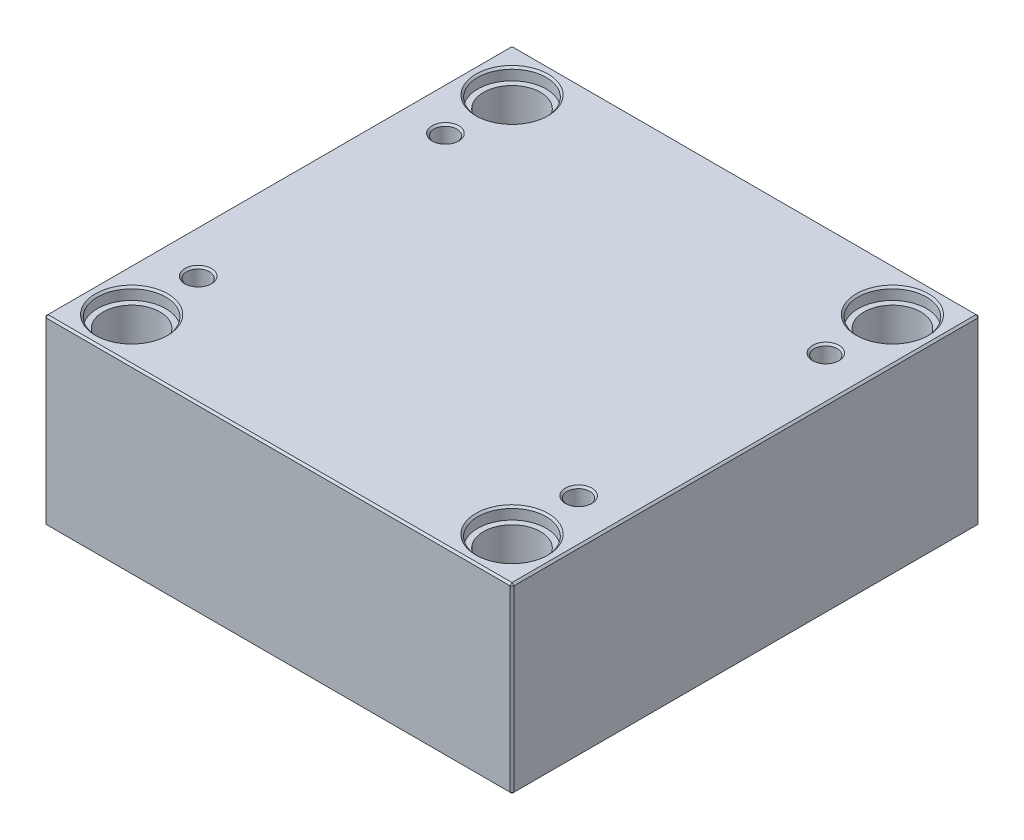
ISO-10303-21;
HEADER;
FILE_DESCRIPTION(('STEP AP214'),'2;1');
FILE_NAME('part.step','',(''),(''),'','','');
FILE_SCHEMA(('AUTOMOTIVE_DESIGN { 1 0 10303 214 1 1 1 1 }'));
ENDSEC;
DATA;
#1=APPLICATION_CONTEXT('core data for automotive mechanical design processes');
#2=APPLICATION_PROTOCOL_DEFINITION('international standard','automotive_design',2000,#1);
#3=PRODUCT_CONTEXT('',#1,'mechanical');
#4=PRODUCT('Part','Part','',(#3));
#5=PRODUCT_RELATED_PRODUCT_CATEGORY('part','',(#4));
#6=PRODUCT_DEFINITION_FORMATION('','',#4);
#7=PRODUCT_DEFINITION_CONTEXT('part definition',#1,'design');
#8=PRODUCT_DEFINITION('design','',#6,#7);
#9=PRODUCT_DEFINITION_SHAPE('','',#8);
#10=(LENGTH_UNIT() NAMED_UNIT(*) SI_UNIT(.MILLI.,.METRE.));
#11=(NAMED_UNIT(*) PLANE_ANGLE_UNIT() SI_UNIT($,.RADIAN.));
#12=(NAMED_UNIT(*) SI_UNIT($,.STERADIAN.) SOLID_ANGLE_UNIT());
#13=UNCERTAINTY_MEASURE_WITH_UNIT(LENGTH_MEASURE(1.E-05),#10,'distance_accuracy_value','');
#14=(GEOMETRIC_REPRESENTATION_CONTEXT(3) GLOBAL_UNCERTAINTY_ASSIGNED_CONTEXT((#13)) GLOBAL_UNIT_ASSIGNED_CONTEXT((#10,
#11,#12)) REPRESENTATION_CONTEXT('',''));
#15=CARTESIAN_POINT('',(0.,0.,0.));
#16=DIRECTION('',(0.,0.,1.));
#17=DIRECTION('',(1.,0.,0.));
#18=AXIS2_PLACEMENT_3D('',#15,#16,#17);
#19=CARTESIAN_POINT('',(-100.,0.,-100.));
#20=DIRECTION('',(0.,1.,0.));
#21=DIRECTION('',(0.,0.,1.));
#22=AXIS2_PLACEMENT_3D('',#19,#20,#21);
#23=CYLINDRICAL_SURFACE('',#22,15.);
#24=CARTESIAN_POINT('',(-100.,1.00000000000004,-100.));
#25=DIRECTION('',(0.,1.,0.));
#26=DIRECTION('',(0.,0.,1.));
#27=AXIS2_PLACEMENT_3D('',#24,#25,#26);
#28=CIRCLE('',#27,15.);
#29=CARTESIAN_POINT('',(-100.,1.00000000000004,-85.));
#30=VERTEX_POINT('',#29);
#31=EDGE_CURVE('E472',#30,#30,#28,.F.);
#32=ORIENTED_EDGE('',*,*,#31,.T.);
#33=EDGE_LOOP('',(#32));
#34=FACE_BOUND('',#33,.T.);
#35=CARTESIAN_POINT('',(-100.,89.7,-100.));
#36=DIRECTION('',(0.,1.,0.));
#37=DIRECTION('',(0.,0.,1.));
#38=AXIS2_PLACEMENT_3D('',#35,#36,#37);
#39=CIRCLE('',#38,15.);
#40=CARTESIAN_POINT('',(-100.,89.7,-85.));
#41=VERTEX_POINT('',#40);
#42=EDGE_CURVE('E221',#41,#41,#39,.F.);
#43=ORIENTED_EDGE('',*,*,#42,.F.);
#44=EDGE_LOOP('',(#43));
#45=FACE_BOUND('',#44,.T.);
#46=ADVANCED_FACE('F16',(#34,#45),#23,.F.);
#47=CARTESIAN_POINT('',(100.,0.,-100.));
#48=DIRECTION('',(0.,1.,0.));
#49=DIRECTION('',(0.,0.,1.));
#50=AXIS2_PLACEMENT_3D('',#47,#48,#49);
#51=CYLINDRICAL_SURFACE('',#50,15.);
#52=CARTESIAN_POINT('',(100.,1.00000000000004,-100.));
#53=DIRECTION('',(0.,1.,0.));
#54=DIRECTION('',(0.,0.,1.));
#55=AXIS2_PLACEMENT_3D('',#52,#53,#54);
#56=CIRCLE('',#55,15.);
#57=CARTESIAN_POINT('',(100.,1.00000000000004,-85.));
#58=VERTEX_POINT('',#57);
#59=EDGE_CURVE('E474',#58,#58,#56,.F.);
#60=ORIENTED_EDGE('',*,*,#59,.T.);
#61=EDGE_LOOP('',(#60));
#62=FACE_BOUND('',#61,.T.);
#63=CARTESIAN_POINT('',(100.,89.7,-100.));
#64=DIRECTION('',(0.,1.,0.));
#65=DIRECTION('',(0.,0.,1.));
#66=AXIS2_PLACEMENT_3D('',#63,#64,#65);
#67=CIRCLE('',#66,15.);
#68=CARTESIAN_POINT('',(100.,89.7,-85.));
#69=VERTEX_POINT('',#68);
#70=EDGE_CURVE('E218',#69,#69,#67,.F.);
#71=ORIENTED_EDGE('',*,*,#70,.F.);
#72=EDGE_LOOP('',(#71));
#73=FACE_BOUND('',#72,.T.);
#74=ADVANCED_FACE('F263',(#62,#73),#51,.F.);
#75=CARTESIAN_POINT('',(100.,0.,100.));
#76=DIRECTION('',(0.,1.,0.));
#77=DIRECTION('',(0.,0.,1.));
#78=AXIS2_PLACEMENT_3D('',#75,#76,#77);
#79=CYLINDRICAL_SURFACE('',#78,15.);
#80=CARTESIAN_POINT('',(100.,1.00000000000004,100.));
#81=DIRECTION('',(0.,1.,0.));
#82=DIRECTION('',(0.,0.,1.));
#83=AXIS2_PLACEMENT_3D('',#80,#81,#82);
#84=CIRCLE('',#83,15.);
#85=CARTESIAN_POINT('',(100.,1.00000000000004,115.));
#86=VERTEX_POINT('',#85);
#87=EDGE_CURVE('E477',#86,#86,#84,.F.);
#88=ORIENTED_EDGE('',*,*,#87,.T.);
#89=EDGE_LOOP('',(#88));
#90=FACE_BOUND('',#89,.T.);
#91=CARTESIAN_POINT('',(100.,89.7,100.));
#92=DIRECTION('',(0.,1.,0.));
#93=DIRECTION('',(0.,0.,1.));
#94=AXIS2_PLACEMENT_3D('',#91,#92,#93);
#95=CIRCLE('',#94,15.);
#96=CARTESIAN_POINT('',(100.,89.7,115.));
#97=VERTEX_POINT('',#96);
#98=EDGE_CURVE('E214',#97,#97,#95,.F.);
#99=ORIENTED_EDGE('',*,*,#98,.F.);
#100=EDGE_LOOP('',(#99));
#101=FACE_BOUND('',#100,.T.);
#102=ADVANCED_FACE('F270',(#90,#101),#79,.F.);
#103=CARTESIAN_POINT('',(-100.,0.,100.));
#104=DIRECTION('',(0.,1.,0.));
#105=DIRECTION('',(0.,0.,1.));
#106=AXIS2_PLACEMENT_3D('',#103,#104,#105);
#107=CYLINDRICAL_SURFACE('',#106,15.);
#108=CARTESIAN_POINT('',(-100.,1.00000000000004,100.));
#109=DIRECTION('',(0.,1.,0.));
#110=DIRECTION('',(0.,0.,1.));
#111=AXIS2_PLACEMENT_3D('',#108,#109,#110);
#112=CIRCLE('',#111,15.);
#113=CARTESIAN_POINT('',(-100.,1.00000000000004,115.));
#114=VERTEX_POINT('',#113);
#115=EDGE_CURVE('E480',#114,#114,#112,.F.);
#116=ORIENTED_EDGE('',*,*,#115,.T.);
#117=EDGE_LOOP('',(#116));
#118=FACE_BOUND('',#117,.T.);
#119=CARTESIAN_POINT('',(-100.,89.7,100.));
#120=DIRECTION('',(0.,1.,0.));
#121=DIRECTION('',(0.,0.,1.));
#122=AXIS2_PLACEMENT_3D('',#119,#120,#121);
#123=CIRCLE('',#122,15.);
#124=CARTESIAN_POINT('',(-100.,89.7,115.));
#125=VERTEX_POINT('',#124);
#126=EDGE_CURVE('E211',#125,#125,#123,.F.);
#127=ORIENTED_EDGE('',*,*,#126,.F.);
#128=EDGE_LOOP('',(#127));
#129=FACE_BOUND('',#128,.T.);
#130=ADVANCED_FACE('F277',(#118,#129),#107,.F.);
#131=CARTESIAN_POINT('',(-123.,96.,123.));
#132=DIRECTION('',(1.,0.,0.));
#133=DIRECTION('',(0.,0.,-1.));
#134=AXIS2_PLACEMENT_3D('',#131,#132,#133);
#135=PLANE('',#134);
#136=DIRECTION('',(0.,-1.,0.));
#137=VECTOR('',#136,1.);
#138=CARTESIAN_POINT('',(-123.,96.,-122.));
#139=LINE('',#138,#137);
#140=CARTESIAN_POINT('',(-123.,95.,-122.));
#141=VERTEX_POINT('',#140);
#142=CARTESIAN_POINT('',(-123.,1.00000000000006,-122.));
#143=VERTEX_POINT('',#142);
#144=EDGE_CURVE('E487',#141,#143,#139,.T.);
#145=ORIENTED_EDGE('',*,*,#144,.T.);
#146=DIRECTION('',(0.,0.,1.));
#147=VECTOR('',#146,1.);
#148=CARTESIAN_POINT('',(-123.,1.00000000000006,123.));
#149=LINE('',#148,#147);
#150=CARTESIAN_POINT('',(-123.,1.00000000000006,122.));
#151=VERTEX_POINT('',#150);
#152=EDGE_CURVE('E490',#143,#151,#149,.T.);
#153=ORIENTED_EDGE('',*,*,#152,.T.);
#154=DIRECTION('',(0.,1.,0.));
#155=VECTOR('',#154,1.);
#156=CARTESIAN_POINT('',(-123.,96.,122.));
#157=LINE('',#156,#155);
#158=CARTESIAN_POINT('',(-123.,95.,122.));
#159=VERTEX_POINT('',#158);
#160=EDGE_CURVE('E485',#151,#159,#157,.T.);
#161=ORIENTED_EDGE('',*,*,#160,.T.);
#162=DIRECTION('',(0.,0.,-1.));
#163=VECTOR('',#162,1.);
#164=CARTESIAN_POINT('',(-123.,95.,-123.));
#165=LINE('',#164,#163);
#166=EDGE_CURVE('E483',#159,#141,#165,.T.);
#167=ORIENTED_EDGE('',*,*,#166,.T.);
#168=EDGE_LOOP('',(#145,#153,#161,#167));
#169=FACE_BOUND('',#168,.T.);
#170=ADVANCED_FACE('F298',(#169),#135,.F.);
#171=CARTESIAN_POINT('',(123.,96.,123.));
#172=DIRECTION('',(0.,0.,-1.));
#173=DIRECTION('',(-1.,0.,0.));
#174=AXIS2_PLACEMENT_3D('',#171,#172,#173);
#175=PLANE('',#174);
#176=DIRECTION('',(-1.,0.,0.));
#177=VECTOR('',#176,1.);
#178=CARTESIAN_POINT('',(-123.,95.,123.));
#179=LINE('',#178,#177);
#180=CARTESIAN_POINT('',(122.,95.,123.));
#181=VERTEX_POINT('',#180);
#182=CARTESIAN_POINT('',(-122.,95.,123.));
#183=VERTEX_POINT('',#182);
#184=EDGE_CURVE('E509',#181,#183,#179,.T.);
#185=ORIENTED_EDGE('',*,*,#184,.T.);
#186=DIRECTION('',(0.,-1.,0.));
#187=VECTOR('',#186,1.);
#188=CARTESIAN_POINT('',(-122.,96.,123.));
#189=LINE('',#188,#187);
#190=CARTESIAN_POINT('',(-122.,1.00000000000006,123.));
#191=VERTEX_POINT('',#190);
#192=EDGE_CURVE('E515',#183,#191,#189,.T.);
#193=ORIENTED_EDGE('',*,*,#192,.T.);
#194=DIRECTION('',(1.,0.,0.));
#195=VECTOR('',#194,1.);
#196=CARTESIAN_POINT('',(123.,1.00000000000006,123.));
#197=LINE('',#196,#195);
#198=CARTESIAN_POINT('',(122.,1.00000000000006,123.));
#199=VERTEX_POINT('',#198);
#200=EDGE_CURVE('E513',#191,#199,#197,.T.);
#201=ORIENTED_EDGE('',*,*,#200,.T.);
#202=DIRECTION('',(0.,1.,0.));
#203=VECTOR('',#202,1.);
#204=CARTESIAN_POINT('',(122.,96.,123.));
#205=LINE('',#204,#203);
#206=EDGE_CURVE('E511',#199,#181,#205,.T.);
#207=ORIENTED_EDGE('',*,*,#206,.T.);
#208=EDGE_LOOP('',(#185,#193,#201,#207));
#209=FACE_BOUND('',#208,.T.);
#210=ADVANCED_FACE('F294',(#209),#175,.F.);
#211=CARTESIAN_POINT('',(123.,96.,123.));
#212=DIRECTION('',(-1.,0.,0.));
#213=DIRECTION('',(0.,0.,1.));
#214=AXIS2_PLACEMENT_3D('',#211,#212,#213);
#215=PLANE('',#214);
#216=DIRECTION('',(0.,0.,-1.));
#217=VECTOR('',#216,1.);
#218=CARTESIAN_POINT('',(123.,1.00000000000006,123.));
#219=LINE('',#218,#217);
#220=CARTESIAN_POINT('',(123.,1.00000000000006,122.));
#221=VERTEX_POINT('',#220);
#222=CARTESIAN_POINT('',(123.,1.00000000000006,-122.));
#223=VERTEX_POINT('',#222);
#224=EDGE_CURVE('E504',#221,#223,#219,.T.);
#225=ORIENTED_EDGE('',*,*,#224,.T.);
#226=DIRECTION('',(0.,1.,0.));
#227=VECTOR('',#226,1.);
#228=CARTESIAN_POINT('',(123.,96.,-122.));
#229=LINE('',#228,#227);
#230=CARTESIAN_POINT('',(123.,95.,-122.));
#231=VERTEX_POINT('',#230);
#232=EDGE_CURVE('E506',#223,#231,#229,.T.);
#233=ORIENTED_EDGE('',*,*,#232,.T.);
#234=DIRECTION('',(0.,0.,1.));
#235=VECTOR('',#234,1.);
#236=CARTESIAN_POINT('',(123.,95.,123.));
#237=LINE('',#236,#235);
#238=CARTESIAN_POINT('',(123.,95.,122.));
#239=VERTEX_POINT('',#238);
#240=EDGE_CURVE('E500',#231,#239,#237,.T.);
#241=ORIENTED_EDGE('',*,*,#240,.T.);
#242=DIRECTION('',(0.,-1.,0.));
#243=VECTOR('',#242,1.);
#244=CARTESIAN_POINT('',(123.,96.,122.));
#245=LINE('',#244,#243);
#246=EDGE_CURVE('E502',#239,#221,#245,.T.);
#247=ORIENTED_EDGE('',*,*,#246,.T.);
#248=EDGE_LOOP('',(#225,#233,#241,#247));
#249=FACE_BOUND('',#248,.T.);
#250=ADVANCED_FACE('F290',(#249),#215,.F.);
#251=CARTESIAN_POINT('',(123.,96.,-123.));
#252=DIRECTION('',(0.,0.,1.));
#253=DIRECTION('',(1.,0.,0.));
#254=AXIS2_PLACEMENT_3D('',#251,#252,#253);
#255=PLANE('',#254);
#256=DIRECTION('',(0.,-1.,0.));
#257=VECTOR('',#256,1.);
#258=CARTESIAN_POINT('',(122.,96.,-123.));
#259=LINE('',#258,#257);
#260=CARTESIAN_POINT('',(122.,95.,-123.));
#261=VERTEX_POINT('',#260);
#262=CARTESIAN_POINT('',(122.,1.00000000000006,-123.));
#263=VERTEX_POINT('',#262);
#264=EDGE_CURVE('E494',#261,#263,#259,.T.);
#265=ORIENTED_EDGE('',*,*,#264,.T.);
#266=DIRECTION('',(-1.,0.,0.));
#267=VECTOR('',#266,1.);
#268=CARTESIAN_POINT('',(123.,1.00000000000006,-123.));
#269=LINE('',#268,#267);
#270=CARTESIAN_POINT('',(-122.,1.00000000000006,-123.));
#271=VERTEX_POINT('',#270);
#272=EDGE_CURVE('E138',#263,#271,#269,.T.);
#273=ORIENTED_EDGE('',*,*,#272,.T.);
#274=DIRECTION('',(0.,1.,0.));
#275=VECTOR('',#274,1.);
#276=CARTESIAN_POINT('',(-122.,96.,-123.));
#277=LINE('',#276,#275);
#278=CARTESIAN_POINT('',(-122.,95.,-123.));
#279=VERTEX_POINT('',#278);
#280=EDGE_CURVE('E496',#271,#279,#277,.T.);
#281=ORIENTED_EDGE('',*,*,#280,.T.);
#282=DIRECTION('',(1.,0.,0.));
#283=VECTOR('',#282,1.);
#284=CARTESIAN_POINT('',(123.,95.,-123.));
#285=LINE('',#284,#283);
#286=EDGE_CURVE('E492',#279,#261,#285,.T.);
#287=ORIENTED_EDGE('',*,*,#286,.T.);
#288=EDGE_LOOP('',(#265,#273,#281,#287));
#289=FACE_BOUND('',#288,.T.);
#290=ADVANCED_FACE('F282',(#289),#255,.F.);
#291=CARTESIAN_POINT('',(0.,96.,0.));
#292=DIRECTION('',(0.,1.,0.));
#293=DIRECTION('',(0.,0.,1.));
#294=AXIS2_PLACEMENT_3D('',#291,#292,#293);
#295=PLANE('',#294);
#296=CARTESIAN_POINT('',(100.,96.,100.));
#297=DIRECTION('',(0.,1.,0.));
#298=DIRECTION('',(0.,0.,1.));
#299=AXIS2_PLACEMENT_3D('',#296,#297,#298);
#300=CIRCLE('',#299,19.);
#301=CARTESIAN_POINT('',(100.,96.,119.));
#302=VERTEX_POINT('',#301);
#303=EDGE_CURVE('E236',#302,#302,#300,.F.);
#304=ORIENTED_EDGE('',*,*,#303,.T.);
#305=EDGE_LOOP('',(#304));
#306=FACE_BOUND('',#305,.T.);
#307=CARTESIAN_POINT('',(-100.,96.,100.));
#308=DIRECTION('',(0.,1.,0.));
#309=DIRECTION('',(0.,0.,1.));
#310=AXIS2_PLACEMENT_3D('',#307,#308,#309);
#311=CIRCLE('',#310,19.);
#312=CARTESIAN_POINT('',(-100.,96.,119.));
#313=VERTEX_POINT('',#312);
#314=EDGE_CURVE('E233',#313,#313,#311,.F.);
#315=ORIENTED_EDGE('',*,*,#314,.T.);
#316=EDGE_LOOP('',(#315));
#317=FACE_BOUND('',#316,.T.);
#318=CARTESIAN_POINT('',(100.,96.,-100.));
#319=DIRECTION('',(0.,1.,0.));
#320=DIRECTION('',(0.,0.,1.));
#321=AXIS2_PLACEMENT_3D('',#318,#319,#320);
#322=CIRCLE('',#321,19.);
#323=CARTESIAN_POINT('',(100.,96.,-81.));
#324=VERTEX_POINT('',#323);
#325=EDGE_CURVE('E230',#324,#324,#322,.F.);
#326=ORIENTED_EDGE('',*,*,#325,.T.);
#327=EDGE_LOOP('',(#326));
#328=FACE_BOUND('',#327,.T.);
#329=CARTESIAN_POINT('',(-100.,96.,-100.));
#330=DIRECTION('',(0.,1.,0.));
#331=DIRECTION('',(0.,0.,1.));
#332=AXIS2_PLACEMENT_3D('',#329,#330,#331);
#333=CIRCLE('',#332,19.);
#334=CARTESIAN_POINT('',(-100.,96.,-81.));
#335=VERTEX_POINT('',#334);
#336=EDGE_CURVE('E227',#335,#335,#333,.F.);
#337=ORIENTED_EDGE('',*,*,#336,.T.);
#338=EDGE_LOOP('',(#337));
#339=FACE_BOUND('',#338,.T.);
#340=CARTESIAN_POINT('',(-100.,96.,65.));
#341=DIRECTION('',(0.,1.,0.));
#342=DIRECTION('',(0.,0.,1.));
#343=AXIS2_PLACEMENT_3D('',#340,#341,#342);
#344=CIRCLE('',#343,7.);
#345=CARTESIAN_POINT('',(-100.,96.,72.));
#346=VERTEX_POINT('',#345);
#347=EDGE_CURVE('E198',#346,#346,#344,.F.);
#348=ORIENTED_EDGE('',*,*,#347,.T.);
#349=EDGE_LOOP('',(#348));
#350=FACE_BOUND('',#349,.T.);
#351=CARTESIAN_POINT('',(100.,96.,65.));
#352=DIRECTION('',(0.,1.,0.));
#353=DIRECTION('',(0.,0.,1.));
#354=AXIS2_PLACEMENT_3D('',#351,#352,#353);
#355=CIRCLE('',#354,7.);
#356=CARTESIAN_POINT('',(100.,96.,72.));
#357=VERTEX_POINT('',#356);
#358=EDGE_CURVE('E195',#357,#357,#355,.F.);
#359=ORIENTED_EDGE('',*,*,#358,.T.);
#360=EDGE_LOOP('',(#359));
#361=FACE_BOUND('',#360,.T.);
#362=CARTESIAN_POINT('',(100.,96.,-65.));
#363=DIRECTION('',(0.,1.,0.));
#364=DIRECTION('',(0.,0.,1.));
#365=AXIS2_PLACEMENT_3D('',#362,#363,#364);
#366=CIRCLE('',#365,7.);
#367=CARTESIAN_POINT('',(100.,96.,-58.));
#368=VERTEX_POINT('',#367);
#369=EDGE_CURVE('E192',#368,#368,#366,.F.);
#370=ORIENTED_EDGE('',*,*,#369,.T.);
#371=EDGE_LOOP('',(#370));
#372=FACE_BOUND('',#371,.T.);
#373=CARTESIAN_POINT('',(-100.,96.,-65.));
#374=DIRECTION('',(0.,1.,0.));
#375=DIRECTION('',(0.,0.,1.));
#376=AXIS2_PLACEMENT_3D('',#373,#374,#375);
#377=CIRCLE('',#376,7.);
#378=CARTESIAN_POINT('',(-100.,96.,-58.));
#379=VERTEX_POINT('',#378);
#380=EDGE_CURVE('E188',#379,#379,#377,.F.);
#381=ORIENTED_EDGE('',*,*,#380,.T.);
#382=EDGE_LOOP('',(#381));
#383=FACE_BOUND('',#382,.T.);
#384=DIRECTION('',(0.,0.,-1.));
#385=VECTOR('',#384,1.);
#386=CARTESIAN_POINT('',(122.,96.,-123.));
#387=LINE('',#386,#385);
#388=CARTESIAN_POINT('',(122.,96.,122.));
#389=VERTEX_POINT('',#388);
#390=CARTESIAN_POINT('',(122.,96.,-122.));
#391=VERTEX_POINT('',#390);
#392=EDGE_CURVE('E31',#389,#391,#387,.T.);
#393=ORIENTED_EDGE('',*,*,#392,.T.);
#394=DIRECTION('',(-1.,0.,0.));
#395=VECTOR('',#394,1.);
#396=CARTESIAN_POINT('',(-123.,96.,-122.));
#397=LINE('',#396,#395);
#398=CARTESIAN_POINT('',(-122.,96.,-122.));
#399=VERTEX_POINT('',#398);
#400=EDGE_CURVE('E189',#391,#399,#397,.T.);
#401=ORIENTED_EDGE('',*,*,#400,.T.);
#402=DIRECTION('',(0.,0.,1.));
#403=VECTOR('',#402,1.);
#404=CARTESIAN_POINT('',(-122.,96.,123.));
#405=LINE('',#404,#403);
#406=CARTESIAN_POINT('',(-122.,96.,122.));
#407=VERTEX_POINT('',#406);
#408=EDGE_CURVE('E518',#399,#407,#405,.T.);
#409=ORIENTED_EDGE('',*,*,#408,.T.);
#410=DIRECTION('',(1.,0.,0.));
#411=VECTOR('',#410,1.);
#412=CARTESIAN_POINT('',(123.,96.,122.));
#413=LINE('',#412,#411);
#414=EDGE_CURVE('E36',#407,#389,#413,.T.);
#415=ORIENTED_EDGE('',*,*,#414,.T.);
#416=EDGE_LOOP('',(#393,#401,#409,#415));
#417=FACE_BOUND('',#416,.T.);
#418=ADVANCED_FACE('F279',(#306,#317,#328,#339,#350,#361,#372,#383,#417),#295,.T.);
#419=CARTESIAN_POINT('',(0.,0.,0.));
#420=DIRECTION('',(0.,1.,0.));
#421=DIRECTION('',(0.,0.,1.));
#422=AXIS2_PLACEMENT_3D('',#419,#420,#421);
#423=PLANE('',#422);
#424=CARTESIAN_POINT('',(-100.,0.,-100.));
#425=DIRECTION('',(0.,1.,0.));
#426=DIRECTION('',(0.,0.,1.));
#427=AXIS2_PLACEMENT_3D('',#424,#425,#426);
#428=CIRCLE('',#427,16.);
#429=CARTESIAN_POINT('',(-100.,0.,-84.));
#430=VERTEX_POINT('',#429);
#431=EDGE_CURVE('E469',#430,#430,#428,.T.);
#432=ORIENTED_EDGE('',*,*,#431,.T.);
#433=EDGE_LOOP('',(#432));
#434=FACE_BOUND('',#433,.T.);
#435=CARTESIAN_POINT('',(100.,0.,-100.));
#436=DIRECTION('',(0.,1.,0.));
#437=DIRECTION('',(0.,0.,1.));
#438=AXIS2_PLACEMENT_3D('',#435,#436,#437);
#439=CIRCLE('',#438,16.);
#440=CARTESIAN_POINT('',(100.,0.,-84.));
#441=VERTEX_POINT('',#440);
#442=EDGE_CURVE('E466',#441,#441,#439,.T.);
#443=ORIENTED_EDGE('',*,*,#442,.T.);
#444=EDGE_LOOP('',(#443));
#445=FACE_BOUND('',#444,.T.);
#446=CARTESIAN_POINT('',(100.,0.,100.));
#447=DIRECTION('',(0.,1.,0.));
#448=DIRECTION('',(0.,0.,1.));
#449=AXIS2_PLACEMENT_3D('',#446,#447,#448);
#450=CIRCLE('',#449,16.);
#451=CARTESIAN_POINT('',(100.,0.,116.));
#452=VERTEX_POINT('',#451);
#453=EDGE_CURVE('E463',#452,#452,#450,.T.);
#454=ORIENTED_EDGE('',*,*,#453,.T.);
#455=EDGE_LOOP('',(#454));
#456=FACE_BOUND('',#455,.T.);
#457=CARTESIAN_POINT('',(-100.,0.,100.));
#458=DIRECTION('',(0.,1.,0.));
#459=DIRECTION('',(0.,0.,1.));
#460=AXIS2_PLACEMENT_3D('',#457,#458,#459);
#461=CIRCLE('',#460,16.);
#462=CARTESIAN_POINT('',(-100.,0.,116.));
#463=VERTEX_POINT('',#462);
#464=EDGE_CURVE('E460',#463,#463,#461,.T.);
#465=ORIENTED_EDGE('',*,*,#464,.T.);
#466=EDGE_LOOP('',(#465));
#467=FACE_BOUND('',#466,.T.);
#468=DIRECTION('',(0.,0.,1.));
#469=VECTOR('',#468,1.);
#470=CARTESIAN_POINT('',(122.,0.,0.));
#471=LINE('',#470,#469);
#472=CARTESIAN_POINT('',(122.,0.,-122.));
#473=VERTEX_POINT('',#472);
#474=CARTESIAN_POINT('',(122.,0.,122.));
#475=VERTEX_POINT('',#474);
#476=EDGE_CURVE('E108',#473,#475,#471,.T.);
#477=ORIENTED_EDGE('',*,*,#476,.T.);
#478=DIRECTION('',(-1.,0.,0.));
#479=VECTOR('',#478,1.);
#480=CARTESIAN_POINT('',(0.,0.,122.));
#481=LINE('',#480,#479);
#482=CARTESIAN_POINT('',(-122.,0.,122.));
#483=VERTEX_POINT('',#482);
#484=EDGE_CURVE('E458',#475,#483,#481,.T.);
#485=ORIENTED_EDGE('',*,*,#484,.T.);
#486=DIRECTION('',(0.,0.,-1.));
#487=VECTOR('',#486,1.);
#488=CARTESIAN_POINT('',(-122.,0.,0.));
#489=LINE('',#488,#487);
#490=CARTESIAN_POINT('',(-122.,0.,-122.));
#491=VERTEX_POINT('',#490);
#492=EDGE_CURVE('E110',#483,#491,#489,.T.);
#493=ORIENTED_EDGE('',*,*,#492,.T.);
#494=DIRECTION('',(1.,0.,0.));
#495=VECTOR('',#494,1.);
#496=CARTESIAN_POINT('',(0.,0.,-122.));
#497=LINE('',#496,#495);
#498=EDGE_CURVE('E104',#491,#473,#497,.T.);
#499=ORIENTED_EDGE('',*,*,#498,.T.);
#500=EDGE_LOOP('',(#477,#485,#493,#499));
#501=FACE_BOUND('',#500,.T.);
#502=ADVANCED_FACE('F106',(#434,#445,#456,#467,#501),#423,.F.);
#503=CARTESIAN_POINT('',(-100.,0.,-100.));
#504=DIRECTION('',(0.,-1.,0.));
#505=DIRECTION('',(0.,0.,-1.));
#506=AXIS2_PLACEMENT_3D('',#503,#504,#505);
#507=CONICAL_SURFACE('',#506,16.,0.785398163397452);
#508=ORIENTED_EDGE('',*,*,#31,.F.);
#509=EDGE_LOOP('',(#508));
#510=FACE_BOUND('',#509,.T.);
#511=ORIENTED_EDGE('',*,*,#431,.F.);
#512=EDGE_LOOP('',(#511));
#513=FACE_BOUND('',#512,.T.);
#514=ADVANCED_FACE('F286',(#510,#513),#507,.F.);
#515=CARTESIAN_POINT('',(100.,0.,-100.));
#516=DIRECTION('',(0.,-1.,0.));
#517=DIRECTION('',(0.,0.,-1.));
#518=AXIS2_PLACEMENT_3D('',#515,#516,#517);
#519=CONICAL_SURFACE('',#518,16.,0.785398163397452);
#520=ORIENTED_EDGE('',*,*,#59,.F.);
#521=EDGE_LOOP('',(#520));
#522=FACE_BOUND('',#521,.T.);
#523=ORIENTED_EDGE('',*,*,#442,.F.);
#524=EDGE_LOOP('',(#523));
#525=FACE_BOUND('',#524,.T.);
#526=ADVANCED_FACE('F305',(#522,#525),#519,.F.);
#527=CARTESIAN_POINT('',(100.,0.,100.));
#528=DIRECTION('',(0.,-1.,0.));
#529=DIRECTION('',(0.,0.,-1.));
#530=AXIS2_PLACEMENT_3D('',#527,#528,#529);
#531=CONICAL_SURFACE('',#530,16.,0.785398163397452);
#532=ORIENTED_EDGE('',*,*,#87,.F.);
#533=EDGE_LOOP('',(#532));
#534=FACE_BOUND('',#533,.T.);
#535=ORIENTED_EDGE('',*,*,#453,.F.);
#536=EDGE_LOOP('',(#535));
#537=FACE_BOUND('',#536,.T.);
#538=ADVANCED_FACE('F309',(#534,#537),#531,.F.);
#539=CARTESIAN_POINT('',(-100.,0.,100.));
#540=DIRECTION('',(0.,-1.,0.));
#541=DIRECTION('',(0.,0.,-1.));
#542=AXIS2_PLACEMENT_3D('',#539,#540,#541);
#543=CONICAL_SURFACE('',#542,16.,0.785398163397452);
#544=ORIENTED_EDGE('',*,*,#115,.F.);
#545=EDGE_LOOP('',(#544));
#546=FACE_BOUND('',#545,.T.);
#547=ORIENTED_EDGE('',*,*,#464,.F.);
#548=EDGE_LOOP('',(#547));
#549=FACE_BOUND('',#548,.T.);
#550=ADVANCED_FACE('F313',(#546,#549),#543,.F.);
#551=CARTESIAN_POINT('',(123.,96.,122.));
#552=DIRECTION('',(-0.707106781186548,0.,-0.707106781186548));
#553=DIRECTION('',(0.,-1.,0.));
#554=AXIS2_PLACEMENT_3D('',#551,#552,#553);
#555=PLANE('',#554);
#556=DIRECTION('',(-0.707106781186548,0.,0.707106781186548));
#557=VECTOR('',#556,1.);
#558=CARTESIAN_POINT('',(122.,95.,123.));
#559=LINE('',#558,#557);
#560=EDGE_CURVE('E126',#181,#239,#559,.F.);
#561=ORIENTED_EDGE('',*,*,#560,.F.);
#562=ORIENTED_EDGE('',*,*,#206,.F.);
#563=DIRECTION('',(0.707106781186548,0.,-0.707106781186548));
#564=VECTOR('',#563,1.);
#565=CARTESIAN_POINT('',(122.,1.00000000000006,123.));
#566=LINE('',#565,#564);
#567=EDGE_CURVE('E180',#221,#199,#566,.F.);
#568=ORIENTED_EDGE('',*,*,#567,.F.);
#569=ORIENTED_EDGE('',*,*,#246,.F.);
#570=EDGE_LOOP('',(#561,#562,#568,#569));
#571=FACE_BOUND('',#570,.T.);
#572=ADVANCED_FACE('F317',(#571),#555,.F.);
#573=CARTESIAN_POINT('',(122.,95.,123.));
#574=DIRECTION('',(0.577350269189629,0.57735026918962,0.577350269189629));
#575=DIRECTION('',(0.707106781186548,0.,-0.707106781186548));
#576=AXIS2_PLACEMENT_3D('',#573,#574,#575);
#577=PLANE('',#576);
#578=DIRECTION('',(0.,-0.70710678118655,0.707106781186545));
#579=VECTOR('',#578,1.);
#580=CARTESIAN_POINT('',(122.,95.,123.));
#581=LINE('',#580,#579);
#582=EDGE_CURVE('E175',#181,#389,#581,.F.);
#583=ORIENTED_EDGE('',*,*,#582,.F.);
#584=ORIENTED_EDGE('',*,*,#560,.T.);
#585=DIRECTION('',(-0.707106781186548,0.707106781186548,0.));
#586=VECTOR('',#585,1.);
#587=CARTESIAN_POINT('',(122.5,95.5,122.));
#588=LINE('',#587,#586);
#589=EDGE_CURVE('E177',#389,#239,#588,.F.);
#590=ORIENTED_EDGE('',*,*,#589,.F.);
#591=EDGE_LOOP('',(#583,#584,#590));
#592=FACE_BOUND('',#591,.T.);
#593=ADVANCED_FACE('F385',(#592),#577,.T.);
#594=CARTESIAN_POINT('',(122.,1.00000000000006,123.));
#595=DIRECTION('',(0.577350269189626,-0.577350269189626,0.577350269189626));
#596=DIRECTION('',(0.707106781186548,0.,-0.707106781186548));
#597=AXIS2_PLACEMENT_3D('',#594,#595,#596);
#598=PLANE('',#597);
#599=DIRECTION('',(-0.707106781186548,-0.707106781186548,0.));
#600=VECTOR('',#599,1.);
#601=CARTESIAN_POINT('',(122.5,0.500000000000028,122.));
#602=LINE('',#601,#600);
#603=EDGE_CURVE('E124',#221,#475,#602,.T.);
#604=ORIENTED_EDGE('',*,*,#603,.F.);
#605=ORIENTED_EDGE('',*,*,#567,.T.);
#606=DIRECTION('',(0.,0.70710678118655,0.707106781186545));
#607=VECTOR('',#606,1.);
#608=CARTESIAN_POINT('',(122.,1.00000000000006,123.));
#609=LINE('',#608,#607);
#610=EDGE_CURVE('E172',#475,#199,#609,.T.);
#611=ORIENTED_EDGE('',*,*,#610,.F.);
#612=EDGE_LOOP('',(#604,#605,#611));
#613=FACE_BOUND('',#612,.T.);
#614=ADVANCED_FACE('F381',(#613),#598,.T.);
#615=CARTESIAN_POINT('',(122.,96.,0.));
#616=DIRECTION('',(0.707106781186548,0.707106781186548,0.));
#617=DIRECTION('',(0.,0.,1.));
#618=AXIS2_PLACEMENT_3D('',#615,#616,#617);
#619=PLANE('',#618);
#620=ORIENTED_EDGE('',*,*,#589,.T.);
#621=ORIENTED_EDGE('',*,*,#240,.F.);
#622=DIRECTION('',(0.707106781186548,-0.707106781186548,0.));
#623=VECTOR('',#622,1.);
#624=CARTESIAN_POINT('',(123.,95.,-122.));
#625=LINE('',#624,#623);
#626=EDGE_CURVE('E166',#391,#231,#625,.T.);
#627=ORIENTED_EDGE('',*,*,#626,.F.);
#628=ORIENTED_EDGE('',*,*,#392,.F.);
#629=EDGE_LOOP('',(#620,#621,#627,#628));
#630=FACE_BOUND('',#629,.T.);
#631=ADVANCED_FACE('F377',(#630),#619,.T.);
#632=CARTESIAN_POINT('',(0.,96.,122.));
#633=DIRECTION('',(0.,0.707106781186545,0.70710678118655));
#634=DIRECTION('',(-1.,0.,0.));
#635=AXIS2_PLACEMENT_3D('',#632,#633,#634);
#636=PLANE('',#635);
#637=ORIENTED_EDGE('',*,*,#582,.T.);
#638=ORIENTED_EDGE('',*,*,#414,.F.);
#639=DIRECTION('',(0.,0.70710678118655,-0.707106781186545));
#640=VECTOR('',#639,1.);
#641=CARTESIAN_POINT('',(-122.,95.5,122.5));
#642=LINE('',#641,#640);
#643=EDGE_CURVE('E163',#183,#407,#642,.T.);
#644=ORIENTED_EDGE('',*,*,#643,.F.);
#645=ORIENTED_EDGE('',*,*,#184,.F.);
#646=EDGE_LOOP('',(#637,#638,#644,#645));
#647=FACE_BOUND('',#646,.T.);
#648=ADVANCED_FACE('F373',(#647),#636,.T.);
#649=CARTESIAN_POINT('',(-122.,96.,123.));
#650=DIRECTION('',(0.707106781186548,0.,-0.707106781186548));
#651=DIRECTION('',(0.,-1.,0.));
#652=AXIS2_PLACEMENT_3D('',#649,#650,#651);
#653=PLANE('',#652);
#654=DIRECTION('',(0.707106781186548,0.,0.707106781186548));
#655=VECTOR('',#654,1.);
#656=CARTESIAN_POINT('',(-122.,1.00000000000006,123.));
#657=LINE('',#656,#655);
#658=EDGE_CURVE('E157',#191,#151,#657,.F.);
#659=ORIENTED_EDGE('',*,*,#658,.F.);
#660=ORIENTED_EDGE('',*,*,#192,.F.);
#661=DIRECTION('',(-0.707106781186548,0.,-0.707106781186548));
#662=VECTOR('',#661,1.);
#663=CARTESIAN_POINT('',(-123.,95.,122.));
#664=LINE('',#663,#662);
#665=EDGE_CURVE('E160',#159,#183,#664,.F.);
#666=ORIENTED_EDGE('',*,*,#665,.F.);
#667=ORIENTED_EDGE('',*,*,#160,.F.);
#668=EDGE_LOOP('',(#659,#660,#666,#667));
#669=FACE_BOUND('',#668,.T.);
#670=ADVANCED_FACE('F369',(#669),#653,.F.);
#671=CARTESIAN_POINT('',(123.,1.00000000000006,123.));
#672=DIRECTION('',(0.,0.707106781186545,-0.70710678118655));
#673=DIRECTION('',(1.,0.,0.));
#674=AXIS2_PLACEMENT_3D('',#671,#672,#673);
#675=PLANE('',#674);
#676=ORIENTED_EDGE('',*,*,#610,.T.);
#677=ORIENTED_EDGE('',*,*,#200,.F.);
#678=DIRECTION('',(0.,-0.70710678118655,-0.707106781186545));
#679=VECTOR('',#678,1.);
#680=CARTESIAN_POINT('',(-122.,1.00000000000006,123.));
#681=LINE('',#680,#679);
#682=EDGE_CURVE('E135',#483,#191,#681,.F.);
#683=ORIENTED_EDGE('',*,*,#682,.F.);
#684=ORIENTED_EDGE('',*,*,#484,.F.);
#685=EDGE_LOOP('',(#676,#677,#683,#684));
#686=FACE_BOUND('',#685,.T.);
#687=ADVANCED_FACE('F366',(#686),#675,.F.);
#688=CARTESIAN_POINT('',(123.,1.00000000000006,123.));
#689=DIRECTION('',(-0.707106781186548,0.707106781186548,0.));
#690=DIRECTION('',(0.,0.,-1.));
#691=AXIS2_PLACEMENT_3D('',#688,#689,#690);
#692=PLANE('',#691);
#693=ORIENTED_EDGE('',*,*,#603,.T.);
#694=ORIENTED_EDGE('',*,*,#476,.F.);
#695=DIRECTION('',(0.707106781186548,0.707106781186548,0.));
#696=VECTOR('',#695,1.);
#697=CARTESIAN_POINT('',(122.5,0.500000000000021,-122.));
#698=LINE('',#697,#696);
#699=EDGE_CURVE('E121',#223,#473,#698,.F.);
#700=ORIENTED_EDGE('',*,*,#699,.F.);
#701=ORIENTED_EDGE('',*,*,#224,.F.);
#702=EDGE_LOOP('',(#693,#694,#700,#701));
#703=FACE_BOUND('',#702,.T.);
#704=ADVANCED_FACE('F119',(#703),#692,.F.);
#705=CARTESIAN_POINT('',(122.,96.,-123.));
#706=DIRECTION('',(-0.707106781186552,0.,0.707106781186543));
#707=DIRECTION('',(0.,-1.,0.));
#708=AXIS2_PLACEMENT_3D('',#705,#706,#707);
#709=PLANE('',#708);
#710=DIRECTION('',(0.707106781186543,0.,0.707106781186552));
#711=VECTOR('',#710,1.);
#712=CARTESIAN_POINT('',(123.,95.,-122.));
#713=LINE('',#712,#711);
#714=EDGE_CURVE('E168',#231,#261,#713,.F.);
#715=ORIENTED_EDGE('',*,*,#714,.F.);
#716=ORIENTED_EDGE('',*,*,#232,.F.);
#717=DIRECTION('',(-0.707106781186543,0.,-0.707106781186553));
#718=VECTOR('',#717,1.);
#719=CARTESIAN_POINT('',(122.,1.00000000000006,-123.));
#720=LINE('',#719,#718);
#721=EDGE_CURVE('E134',#263,#223,#720,.F.);
#722=ORIENTED_EDGE('',*,*,#721,.F.);
#723=ORIENTED_EDGE('',*,*,#264,.F.);
#724=EDGE_LOOP('',(#715,#716,#722,#723));
#725=FACE_BOUND('',#724,.T.);
#726=ADVANCED_FACE('F359',(#725),#709,.F.);
#727=CARTESIAN_POINT('',(123.,95.,-122.));
#728=DIRECTION('',(0.577350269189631,0.577350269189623,-0.577350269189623));
#729=DIRECTION('',(-0.707106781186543,0.,-0.707106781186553));
#730=AXIS2_PLACEMENT_3D('',#727,#728,#729);
#731=PLANE('',#730);
#732=ORIENTED_EDGE('',*,*,#626,.T.);
#733=ORIENTED_EDGE('',*,*,#714,.T.);
#734=DIRECTION('',(0.,0.707106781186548,0.707106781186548));
#735=VECTOR('',#734,1.);
#736=CARTESIAN_POINT('',(122.,95.5,-122.5));
#737=LINE('',#736,#735);
#738=EDGE_CURVE('E152',#391,#261,#737,.F.);
#739=ORIENTED_EDGE('',*,*,#738,.F.);
#740=EDGE_LOOP('',(#732,#733,#739));
#741=FACE_BOUND('',#740,.T.);
#742=ADVANCED_FACE('F355',(#741),#731,.T.);
#743=CARTESIAN_POINT('',(-123.,95.,122.));
#744=DIRECTION('',(-0.577350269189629,0.57735026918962,0.577350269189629));
#745=DIRECTION('',(0.707106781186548,0.,0.707106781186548));
#746=AXIS2_PLACEMENT_3D('',#743,#744,#745);
#747=PLANE('',#746);
#748=ORIENTED_EDGE('',*,*,#665,.T.);
#749=ORIENTED_EDGE('',*,*,#643,.T.);
#750=DIRECTION('',(-0.707106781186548,-0.707106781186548,0.));
#751=VECTOR('',#750,1.);
#752=CARTESIAN_POINT('',(-123.,95.,122.));
#753=LINE('',#752,#751);
#754=EDGE_CURVE('E143',#159,#407,#753,.F.);
#755=ORIENTED_EDGE('',*,*,#754,.F.);
#756=EDGE_LOOP('',(#748,#749,#755));
#757=FACE_BOUND('',#756,.T.);
#758=ADVANCED_FACE('F351',(#757),#747,.T.);
#759=CARTESIAN_POINT('',(-122.,1.00000000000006,123.));
#760=DIRECTION('',(-0.577350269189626,-0.577350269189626,0.577350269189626));
#761=DIRECTION('',(0.707106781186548,0.,0.707106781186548));
#762=AXIS2_PLACEMENT_3D('',#759,#760,#761);
#763=PLANE('',#762);
#764=ORIENTED_EDGE('',*,*,#682,.T.);
#765=ORIENTED_EDGE('',*,*,#658,.T.);
#766=DIRECTION('',(-0.707106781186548,0.707106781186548,0.));
#767=VECTOR('',#766,1.);
#768=CARTESIAN_POINT('',(-122.5,0.500000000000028,122.));
#769=LINE('',#768,#767);
#770=EDGE_CURVE('E139',#483,#151,#769,.T.);
#771=ORIENTED_EDGE('',*,*,#770,.F.);
#772=EDGE_LOOP('',(#764,#765,#771));
#773=FACE_BOUND('',#772,.T.);
#774=ADVANCED_FACE('F348',(#773),#763,.T.);
#775=CARTESIAN_POINT('',(122.,1.00000000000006,-123.));
#776=DIRECTION('',(0.577350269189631,-0.577350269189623,-0.577350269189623));
#777=DIRECTION('',(-0.707106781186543,0.,-0.707106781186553));
#778=AXIS2_PLACEMENT_3D('',#775,#776,#777);
#779=PLANE('',#778);
#780=ORIENTED_EDGE('',*,*,#721,.T.);
#781=ORIENTED_EDGE('',*,*,#699,.T.);
#782=DIRECTION('',(0.,-0.707106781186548,0.707106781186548));
#783=VECTOR('',#782,1.);
#784=CARTESIAN_POINT('',(122.,1.00000000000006,-123.));
#785=LINE('',#784,#783);
#786=EDGE_CURVE('E131',#263,#473,#785,.T.);
#787=ORIENTED_EDGE('',*,*,#786,.F.);
#788=EDGE_LOOP('',(#780,#781,#787));
#789=FACE_BOUND('',#788,.T.);
#790=ADVANCED_FACE('F130',(#789),#779,.T.);
#791=CARTESIAN_POINT('',(0.,96.,-122.));
#792=DIRECTION('',(0.,0.707106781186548,-0.707106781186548));
#793=DIRECTION('',(1.,0.,0.));
#794=AXIS2_PLACEMENT_3D('',#791,#792,#793);
#795=PLANE('',#794);
#796=ORIENTED_EDGE('',*,*,#738,.T.);
#797=ORIENTED_EDGE('',*,*,#286,.F.);
#798=DIRECTION('',(0.,-0.707106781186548,-0.707106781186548));
#799=VECTOR('',#798,1.);
#800=CARTESIAN_POINT('',(-122.,95.,-123.));
#801=LINE('',#800,#799);
#802=EDGE_CURVE('E140',#399,#279,#801,.T.);
#803=ORIENTED_EDGE('',*,*,#802,.F.);
#804=ORIENTED_EDGE('',*,*,#400,.F.);
#805=EDGE_LOOP('',(#796,#797,#803,#804));
#806=FACE_BOUND('',#805,.T.);
#807=ADVANCED_FACE('F341',(#806),#795,.T.);
#808=CARTESIAN_POINT('',(-122.,96.,0.));
#809=DIRECTION('',(-0.707106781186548,0.707106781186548,0.));
#810=DIRECTION('',(0.,0.,-1.));
#811=AXIS2_PLACEMENT_3D('',#808,#809,#810);
#812=PLANE('',#811);
#813=ORIENTED_EDGE('',*,*,#754,.T.);
#814=ORIENTED_EDGE('',*,*,#408,.F.);
#815=DIRECTION('',(0.707106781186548,0.707106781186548,0.));
#816=VECTOR('',#815,1.);
#817=CARTESIAN_POINT('',(-122.5,95.5,-122.));
#818=LINE('',#817,#816);
#819=EDGE_CURVE('E146',#141,#399,#818,.T.);
#820=ORIENTED_EDGE('',*,*,#819,.F.);
#821=ORIENTED_EDGE('',*,*,#166,.F.);
#822=EDGE_LOOP('',(#813,#814,#820,#821));
#823=FACE_BOUND('',#822,.T.);
#824=ADVANCED_FACE('F337',(#823),#812,.T.);
#825=CARTESIAN_POINT('',(-123.,1.00000000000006,123.));
#826=DIRECTION('',(0.707106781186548,0.707106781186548,0.));
#827=DIRECTION('',(0.,0.,1.));
#828=AXIS2_PLACEMENT_3D('',#825,#826,#827);
#829=PLANE('',#828);
#830=ORIENTED_EDGE('',*,*,#770,.T.);
#831=ORIENTED_EDGE('',*,*,#152,.F.);
#832=DIRECTION('',(0.707106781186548,-0.707106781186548,0.));
#833=VECTOR('',#832,1.);
#834=CARTESIAN_POINT('',(-123.,1.00000000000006,-122.));
#835=LINE('',#834,#833);
#836=EDGE_CURVE('E529',#491,#143,#835,.F.);
#837=ORIENTED_EDGE('',*,*,#836,.F.);
#838=ORIENTED_EDGE('',*,*,#492,.F.);
#839=EDGE_LOOP('',(#830,#831,#837,#838));
#840=FACE_BOUND('',#839,.T.);
#841=ADVANCED_FACE('F334',(#840),#829,.F.);
#842=CARTESIAN_POINT('',(123.,1.00000000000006,-123.));
#843=DIRECTION('',(0.,0.707106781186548,0.707106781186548));
#844=DIRECTION('',(-1.,0.,0.));
#845=AXIS2_PLACEMENT_3D('',#842,#843,#844);
#846=PLANE('',#845);
#847=ORIENTED_EDGE('',*,*,#786,.T.);
#848=ORIENTED_EDGE('',*,*,#498,.F.);
#849=DIRECTION('',(0.,0.707106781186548,-0.707106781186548));
#850=VECTOR('',#849,1.);
#851=CARTESIAN_POINT('',(-122.,0.500000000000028,-122.5));
#852=LINE('',#851,#850);
#853=EDGE_CURVE('E526',#271,#491,#852,.F.);
#854=ORIENTED_EDGE('',*,*,#853,.F.);
#855=ORIENTED_EDGE('',*,*,#272,.F.);
#856=EDGE_LOOP('',(#847,#848,#854,#855));
#857=FACE_BOUND('',#856,.T.);
#858=ADVANCED_FACE('F137',(#857),#846,.F.);
#859=CARTESIAN_POINT('',(-122.,95.,-123.));
#860=DIRECTION('',(-0.577350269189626,0.577350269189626,-0.577350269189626));
#861=DIRECTION('',(-0.707106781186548,0.,0.707106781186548));
#862=AXIS2_PLACEMENT_3D('',#859,#860,#861);
#863=PLANE('',#862);
#864=ORIENTED_EDGE('',*,*,#819,.T.);
#865=ORIENTED_EDGE('',*,*,#802,.T.);
#866=DIRECTION('',(0.707106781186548,0.,-0.707106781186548));
#867=VECTOR('',#866,1.);
#868=CARTESIAN_POINT('',(-122.,95.,-123.));
#869=LINE('',#868,#867);
#870=EDGE_CURVE('E524',#141,#279,#869,.T.);
#871=ORIENTED_EDGE('',*,*,#870,.F.);
#872=EDGE_LOOP('',(#864,#865,#871));
#873=FACE_BOUND('',#872,.T.);
#874=ADVANCED_FACE('F327',(#873),#863,.T.);
#875=CARTESIAN_POINT('',(-123.,1.00000000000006,-122.));
#876=DIRECTION('',(-0.577350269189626,-0.577350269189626,-0.577350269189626));
#877=DIRECTION('',(-0.707106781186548,0.,0.707106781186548));
#878=AXIS2_PLACEMENT_3D('',#875,#876,#877);
#879=PLANE('',#878);
#880=ORIENTED_EDGE('',*,*,#853,.T.);
#881=ORIENTED_EDGE('',*,*,#836,.T.);
#882=DIRECTION('',(-0.707106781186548,0.,0.707106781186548));
#883=VECTOR('',#882,1.);
#884=CARTESIAN_POINT('',(-123.,1.00000000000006,-122.));
#885=LINE('',#884,#883);
#886=EDGE_CURVE('E455',#271,#143,#885,.T.);
#887=ORIENTED_EDGE('',*,*,#886,.F.);
#888=EDGE_LOOP('',(#880,#881,#887));
#889=FACE_BOUND('',#888,.T.);
#890=ADVANCED_FACE('F323',(#889),#879,.T.);
#891=CARTESIAN_POINT('',(-123.,96.,-122.));
#892=DIRECTION('',(0.707106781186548,0.,0.707106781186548));
#893=DIRECTION('',(0.,-1.,0.));
#894=AXIS2_PLACEMENT_3D('',#891,#892,#893);
#895=PLANE('',#894);
#896=ORIENTED_EDGE('',*,*,#870,.T.);
#897=ORIENTED_EDGE('',*,*,#280,.F.);
#898=ORIENTED_EDGE('',*,*,#886,.T.);
#899=ORIENTED_EDGE('',*,*,#144,.F.);
#900=EDGE_LOOP('',(#896,#897,#898,#899));
#901=FACE_BOUND('',#900,.T.);
#902=ADVANCED_FACE('F319',(#901),#895,.F.);
#903=CARTESIAN_POINT('',(-100.,72.,-65.));
#904=DIRECTION('',(0.,1.,0.));
#905=DIRECTION('',(0.,0.,1.));
#906=AXIS2_PLACEMENT_3D('',#903,#904,#905);
#907=CYLINDRICAL_SURFACE('',#906,6.);
#908=CARTESIAN_POINT('',(-100.,95.,-65.));
#909=DIRECTION('',(0.,1.,0.));
#910=DIRECTION('',(0.,0.,1.));
#911=AXIS2_PLACEMENT_3D('',#908,#909,#910);
#912=CIRCLE('',#911,6.);
#913=CARTESIAN_POINT('',(-100.,95.,-59.));
#914=VERTEX_POINT('',#913);
#915=EDGE_CURVE('E207',#914,#914,#912,.T.);
#916=ORIENTED_EDGE('',*,*,#915,.T.);
#917=EDGE_LOOP('',(#916));
#918=FACE_BOUND('',#917,.T.);
#919=CARTESIAN_POINT('',(-100.,72.,-65.));
#920=DIRECTION('',(0.,1.,0.));
#921=DIRECTION('',(0.,0.,1.));
#922=AXIS2_PLACEMENT_3D('',#919,#920,#921);
#923=CIRCLE('',#922,6.);
#924=CARTESIAN_POINT('',(-100.,72.,-59.));
#925=VERTEX_POINT('',#924);
#926=EDGE_CURVE('E448',#925,#925,#923,.T.);
#927=ORIENTED_EDGE('',*,*,#926,.F.);
#928=EDGE_LOOP('',(#927));
#929=FACE_BOUND('',#928,.T.);
#930=ADVANCED_FACE('F322',(#918,#929),#907,.F.);
#931=CARTESIAN_POINT('',(-100.,72.,-65.));
#932=DIRECTION('',(0.,1.,0.));
#933=DIRECTION('',(0.,0.,1.));
#934=AXIS2_PLACEMENT_3D('',#931,#932,#933);
#935=PLANE('',#934);
#936=ORIENTED_EDGE('',*,*,#926,.T.);
#937=EDGE_LOOP('',(#936));
#938=FACE_BOUND('',#937,.T.);
#939=ADVANCED_FACE('F596',(#938),#935,.T.);
#940=CARTESIAN_POINT('',(100.,72.,-65.));
#941=DIRECTION('',(0.,1.,0.));
#942=DIRECTION('',(0.,0.,1.));
#943=AXIS2_PLACEMENT_3D('',#940,#941,#942);
#944=CYLINDRICAL_SURFACE('',#943,6.);
#945=CARTESIAN_POINT('',(100.,95.,-65.));
#946=DIRECTION('',(0.,1.,0.));
#947=DIRECTION('',(0.,0.,1.));
#948=AXIS2_PLACEMENT_3D('',#945,#946,#947);
#949=CIRCLE('',#948,6.);
#950=CARTESIAN_POINT('',(100.,95.,-59.));
#951=VERTEX_POINT('',#950);
#952=EDGE_CURVE('E204',#951,#951,#949,.T.);
#953=ORIENTED_EDGE('',*,*,#952,.T.);
#954=EDGE_LOOP('',(#953));
#955=FACE_BOUND('',#954,.T.);
#956=CARTESIAN_POINT('',(100.,72.,-65.));
#957=DIRECTION('',(0.,1.,0.));
#958=DIRECTION('',(0.,0.,1.));
#959=AXIS2_PLACEMENT_3D('',#956,#957,#958);
#960=CIRCLE('',#959,6.);
#961=CARTESIAN_POINT('',(100.,72.,-59.));
#962=VERTEX_POINT('',#961);
#963=EDGE_CURVE('E445',#962,#962,#960,.T.);
#964=ORIENTED_EDGE('',*,*,#963,.F.);
#965=EDGE_LOOP('',(#964));
#966=FACE_BOUND('',#965,.T.);
#967=ADVANCED_FACE('F592',(#955,#966),#944,.F.);
#968=CARTESIAN_POINT('',(100.,72.,-65.));
#969=DIRECTION('',(0.,1.,0.));
#970=DIRECTION('',(0.,0.,1.));
#971=AXIS2_PLACEMENT_3D('',#968,#969,#970);
#972=PLANE('',#971);
#973=ORIENTED_EDGE('',*,*,#963,.T.);
#974=EDGE_LOOP('',(#973));
#975=FACE_BOUND('',#974,.T.);
#976=ADVANCED_FACE('F588',(#975),#972,.T.);
#977=CARTESIAN_POINT('',(100.,72.,65.));
#978=DIRECTION('',(0.,1.,0.));
#979=DIRECTION('',(0.,0.,1.));
#980=AXIS2_PLACEMENT_3D('',#977,#978,#979);
#981=CYLINDRICAL_SURFACE('',#980,6.);
#982=CARTESIAN_POINT('',(100.,95.,65.));
#983=DIRECTION('',(0.,1.,0.));
#984=DIRECTION('',(0.,0.,1.));
#985=AXIS2_PLACEMENT_3D('',#982,#983,#984);
#986=CIRCLE('',#985,6.);
#987=CARTESIAN_POINT('',(100.,95.,71.));
#988=VERTEX_POINT('',#987);
#989=EDGE_CURVE('E201',#988,#988,#986,.T.);
#990=ORIENTED_EDGE('',*,*,#989,.T.);
#991=EDGE_LOOP('',(#990));
#992=FACE_BOUND('',#991,.T.);
#993=CARTESIAN_POINT('',(100.,72.,65.));
#994=DIRECTION('',(0.,1.,0.));
#995=DIRECTION('',(0.,0.,1.));
#996=AXIS2_PLACEMENT_3D('',#993,#994,#995);
#997=CIRCLE('',#996,6.);
#998=CARTESIAN_POINT('',(100.,72.,71.));
#999=VERTEX_POINT('',#998);
#1000=EDGE_CURVE('E449',#999,#999,#997,.T.);
#1001=ORIENTED_EDGE('',*,*,#1000,.F.);
#1002=EDGE_LOOP('',(#1001));
#1003=FACE_BOUND('',#1002,.T.);
#1004=ADVANCED_FACE('F591',(#992,#1003),#981,.F.);
#1005=CARTESIAN_POINT('',(100.,72.,65.));
#1006=DIRECTION('',(0.,1.,0.));
#1007=DIRECTION('',(0.,0.,1.));
#1008=AXIS2_PLACEMENT_3D('',#1005,#1006,#1007);
#1009=PLANE('',#1008);
#1010=ORIENTED_EDGE('',*,*,#1000,.T.);
#1011=EDGE_LOOP('',(#1010));
#1012=FACE_BOUND('',#1011,.T.);
#1013=ADVANCED_FACE('F598',(#1012),#1009,.T.);
#1014=CARTESIAN_POINT('',(-100.,72.,65.));
#1015=DIRECTION('',(0.,1.,0.));
#1016=DIRECTION('',(0.,0.,1.));
#1017=AXIS2_PLACEMENT_3D('',#1014,#1015,#1016);
#1018=CYLINDRICAL_SURFACE('',#1017,6.);
#1019=CARTESIAN_POINT('',(-100.,95.,65.));
#1020=DIRECTION('',(0.,1.,0.));
#1021=DIRECTION('',(0.,0.,1.));
#1022=AXIS2_PLACEMENT_3D('',#1019,#1020,#1021);
#1023=CIRCLE('',#1022,6.);
#1024=CARTESIAN_POINT('',(-100.,95.,71.));
#1025=VERTEX_POINT('',#1024);
#1026=EDGE_CURVE('E185',#1025,#1025,#1023,.T.);
#1027=ORIENTED_EDGE('',*,*,#1026,.T.);
#1028=EDGE_LOOP('',(#1027));
#1029=FACE_BOUND('',#1028,.T.);
#1030=CARTESIAN_POINT('',(-100.,72.,65.));
#1031=DIRECTION('',(0.,1.,0.));
#1032=DIRECTION('',(0.,0.,1.));
#1033=AXIS2_PLACEMENT_3D('',#1030,#1031,#1032);
#1034=CIRCLE('',#1033,6.);
#1035=CARTESIAN_POINT('',(-100.,72.,71.));
#1036=VERTEX_POINT('',#1035);
#1037=EDGE_CURVE('E224',#1036,#1036,#1034,.T.);
#1038=ORIENTED_EDGE('',*,*,#1037,.F.);
#1039=EDGE_LOOP('',(#1038));
#1040=FACE_BOUND('',#1039,.T.);
#1041=ADVANCED_FACE('F601',(#1029,#1040),#1018,.F.);
#1042=CARTESIAN_POINT('',(-100.,72.,65.));
#1043=DIRECTION('',(0.,1.,0.));
#1044=DIRECTION('',(0.,0.,1.));
#1045=AXIS2_PLACEMENT_3D('',#1042,#1043,#1044);
#1046=PLANE('',#1045);
#1047=ORIENTED_EDGE('',*,*,#1037,.T.);
#1048=EDGE_LOOP('',(#1047));
#1049=FACE_BOUND('',#1048,.T.);
#1050=ADVANCED_FACE('F397',(#1049),#1046,.T.);
#1051=CARTESIAN_POINT('',(-100.,95.,65.));
#1052=DIRECTION('',(0.,1.,0.));
#1053=DIRECTION('',(0.,0.,1.));
#1054=AXIS2_PLACEMENT_3D('',#1051,#1052,#1053);
#1055=CONICAL_SURFACE('',#1054,6.,0.785398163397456);
#1056=ORIENTED_EDGE('',*,*,#347,.F.);
#1057=EDGE_LOOP('',(#1056));
#1058=FACE_BOUND('',#1057,.T.);
#1059=ORIENTED_EDGE('',*,*,#1026,.F.);
#1060=EDGE_LOOP('',(#1059));
#1061=FACE_BOUND('',#1060,.T.);
#1062=ADVANCED_FACE('F393',(#1058,#1061),#1055,.F.);
#1063=CARTESIAN_POINT('',(100.,95.,65.));
#1064=DIRECTION('',(0.,1.,0.));
#1065=DIRECTION('',(0.,0.,1.));
#1066=AXIS2_PLACEMENT_3D('',#1063,#1064,#1065);
#1067=CONICAL_SURFACE('',#1066,6.,0.785398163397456);
#1068=ORIENTED_EDGE('',*,*,#358,.F.);
#1069=EDGE_LOOP('',(#1068));
#1070=FACE_BOUND('',#1069,.T.);
#1071=ORIENTED_EDGE('',*,*,#989,.F.);
#1072=EDGE_LOOP('',(#1071));
#1073=FACE_BOUND('',#1072,.T.);
#1074=ADVANCED_FACE('F396',(#1070,#1073),#1067,.F.);
#1075=CARTESIAN_POINT('',(100.,95.,-65.));
#1076=DIRECTION('',(0.,1.,0.));
#1077=DIRECTION('',(0.,0.,1.));
#1078=AXIS2_PLACEMENT_3D('',#1075,#1076,#1077);
#1079=CONICAL_SURFACE('',#1078,6.,0.785398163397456);
#1080=ORIENTED_EDGE('',*,*,#369,.F.);
#1081=EDGE_LOOP('',(#1080));
#1082=FACE_BOUND('',#1081,.T.);
#1083=ORIENTED_EDGE('',*,*,#952,.F.);
#1084=EDGE_LOOP('',(#1083));
#1085=FACE_BOUND('',#1084,.T.);
#1086=ADVANCED_FACE('F401',(#1082,#1085),#1079,.F.);
#1087=CARTESIAN_POINT('',(-100.,95.,-65.));
#1088=DIRECTION('',(0.,1.,0.));
#1089=DIRECTION('',(0.,0.,1.));
#1090=AXIS2_PLACEMENT_3D('',#1087,#1088,#1089);
#1091=CONICAL_SURFACE('',#1090,6.,0.785398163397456);
#1092=ORIENTED_EDGE('',*,*,#380,.F.);
#1093=EDGE_LOOP('',(#1092));
#1094=FACE_BOUND('',#1093,.T.);
#1095=ORIENTED_EDGE('',*,*,#915,.F.);
#1096=EDGE_LOOP('',(#1095));
#1097=FACE_BOUND('',#1096,.T.);
#1098=ADVANCED_FACE('F405',(#1094,#1097),#1091,.F.);
#1099=CARTESIAN_POINT('',(-100.,89.7,100.));
#1100=DIRECTION('',(0.,1.,0.));
#1101=DIRECTION('',(0.,0.,1.));
#1102=AXIS2_PLACEMENT_3D('',#1099,#1100,#1101);
#1103=PLANE('',#1102);
#1104=CARTESIAN_POINT('',(-100.,89.7,100.));
#1105=DIRECTION('',(0.,1.,0.));
#1106=DIRECTION('',(0.,0.,1.));
#1107=AXIS2_PLACEMENT_3D('',#1104,#1105,#1106);
#1108=CIRCLE('',#1107,18.);
#1109=CARTESIAN_POINT('',(-100.,89.7,118.));
#1110=VERTEX_POINT('',#1109);
#1111=EDGE_CURVE('E436',#1110,#1110,#1108,.T.);
#1112=ORIENTED_EDGE('',*,*,#1111,.T.);
#1113=EDGE_LOOP('',(#1112));
#1114=FACE_BOUND('',#1113,.T.);
#1115=ORIENTED_EDGE('',*,*,#126,.T.);
#1116=EDGE_LOOP('',(#1115));
#1117=FACE_BOUND('',#1116,.T.);
#1118=ADVANCED_FACE('F409',(#1114,#1117),#1103,.T.);
#1119=CARTESIAN_POINT('',(-100.,89.7,100.));
#1120=DIRECTION('',(0.,1.,0.));
#1121=DIRECTION('',(0.,0.,1.));
#1122=AXIS2_PLACEMENT_3D('',#1119,#1120,#1121);
#1123=CYLINDRICAL_SURFACE('',#1122,18.);
#1124=CARTESIAN_POINT('',(-100.,95.,100.));
#1125=DIRECTION('',(0.,1.,0.));
#1126=DIRECTION('',(0.,0.,1.));
#1127=AXIS2_PLACEMENT_3D('',#1124,#1125,#1126);
#1128=CIRCLE('',#1127,18.);
#1129=CARTESIAN_POINT('',(-100.,95.,118.));
#1130=VERTEX_POINT('',#1129);
#1131=EDGE_CURVE('E239',#1130,#1130,#1128,.T.);
#1132=ORIENTED_EDGE('',*,*,#1131,.T.);
#1133=EDGE_LOOP('',(#1132));
#1134=FACE_BOUND('',#1133,.T.);
#1135=ORIENTED_EDGE('',*,*,#1111,.F.);
#1136=EDGE_LOOP('',(#1135));
#1137=FACE_BOUND('',#1136,.T.);
#1138=ADVANCED_FACE('F574',(#1134,#1137),#1123,.F.);
#1139=CARTESIAN_POINT('',(100.,89.7,100.));
#1140=DIRECTION('',(0.,1.,0.));
#1141=DIRECTION('',(0.,0.,1.));
#1142=AXIS2_PLACEMENT_3D('',#1139,#1140,#1141);
#1143=PLANE('',#1142);
#1144=CARTESIAN_POINT('',(100.,89.7,100.));
#1145=DIRECTION('',(0.,1.,0.));
#1146=DIRECTION('',(0.,0.,1.));
#1147=AXIS2_PLACEMENT_3D('',#1144,#1145,#1146);
#1148=CIRCLE('',#1147,18.);
#1149=CARTESIAN_POINT('',(100.,89.7,118.));
#1150=VERTEX_POINT('',#1149);
#1151=EDGE_CURVE('E433',#1150,#1150,#1148,.T.);
#1152=ORIENTED_EDGE('',*,*,#1151,.T.);
#1153=EDGE_LOOP('',(#1152));
#1154=FACE_BOUND('',#1153,.T.);
#1155=ORIENTED_EDGE('',*,*,#98,.T.);
#1156=EDGE_LOOP('',(#1155));
#1157=FACE_BOUND('',#1156,.T.);
#1158=ADVANCED_FACE('F429',(#1154,#1157),#1143,.T.);
#1159=CARTESIAN_POINT('',(100.,89.7,100.));
#1160=DIRECTION('',(0.,1.,0.));
#1161=DIRECTION('',(0.,0.,1.));
#1162=AXIS2_PLACEMENT_3D('',#1159,#1160,#1161);
#1163=CYLINDRICAL_SURFACE('',#1162,18.);
#1164=CARTESIAN_POINT('',(100.,95.,100.));
#1165=DIRECTION('',(0.,1.,0.));
#1166=DIRECTION('',(0.,0.,1.));
#1167=AXIS2_PLACEMENT_3D('',#1164,#1165,#1166);
#1168=CIRCLE('',#1167,18.);
#1169=CARTESIAN_POINT('',(100.,95.,118.));
#1170=VERTEX_POINT('',#1169);
#1171=EDGE_CURVE('E210',#1170,#1170,#1168,.T.);
#1172=ORIENTED_EDGE('',*,*,#1171,.T.);
#1173=EDGE_LOOP('',(#1172));
#1174=FACE_BOUND('',#1173,.T.);
#1175=ORIENTED_EDGE('',*,*,#1151,.F.);
#1176=EDGE_LOOP('',(#1175));
#1177=FACE_BOUND('',#1176,.T.);
#1178=ADVANCED_FACE('F425',(#1174,#1177),#1163,.F.);
#1179=CARTESIAN_POINT('',(100.,89.7,-100.));
#1180=DIRECTION('',(0.,1.,0.));
#1181=DIRECTION('',(0.,0.,1.));
#1182=AXIS2_PLACEMENT_3D('',#1179,#1180,#1181);
#1183=PLANE('',#1182);
#1184=CARTESIAN_POINT('',(100.,89.7,-100.));
#1185=DIRECTION('',(0.,1.,0.));
#1186=DIRECTION('',(0.,0.,1.));
#1187=AXIS2_PLACEMENT_3D('',#1184,#1185,#1186);
#1188=CIRCLE('',#1187,18.);
#1189=CARTESIAN_POINT('',(100.,89.7,-82.));
#1190=VERTEX_POINT('',#1189);
#1191=EDGE_CURVE('E435',#1190,#1190,#1188,.T.);
#1192=ORIENTED_EDGE('',*,*,#1191,.T.);
#1193=EDGE_LOOP('',(#1192));
#1194=FACE_BOUND('',#1193,.T.);
#1195=ORIENTED_EDGE('',*,*,#70,.T.);
#1196=EDGE_LOOP('',(#1195));
#1197=FACE_BOUND('',#1196,.T.);
#1198=ADVANCED_FACE('F428',(#1194,#1197),#1183,.T.);
#1199=CARTESIAN_POINT('',(100.,89.7,-100.));
#1200=DIRECTION('',(0.,1.,0.));
#1201=DIRECTION('',(0.,0.,1.));
#1202=AXIS2_PLACEMENT_3D('',#1199,#1200,#1201);
#1203=CYLINDRICAL_SURFACE('',#1202,18.);
#1204=CARTESIAN_POINT('',(100.,95.,-100.));
#1205=DIRECTION('',(0.,1.,0.));
#1206=DIRECTION('',(0.,0.,1.));
#1207=AXIS2_PLACEMENT_3D('',#1204,#1205,#1206);
#1208=CIRCLE('',#1207,18.);
#1209=CARTESIAN_POINT('',(100.,95.,-82.));
#1210=VERTEX_POINT('',#1209);
#1211=EDGE_CURVE('E24',#1210,#1210,#1208,.T.);
#1212=ORIENTED_EDGE('',*,*,#1211,.T.);
#1213=EDGE_LOOP('',(#1212));
#1214=FACE_BOUND('',#1213,.T.);
#1215=ORIENTED_EDGE('',*,*,#1191,.F.);
#1216=EDGE_LOOP('',(#1215));
#1217=FACE_BOUND('',#1216,.T.);
#1218=ADVANCED_FACE('F244',(#1214,#1217),#1203,.F.);
#1219=CARTESIAN_POINT('',(-100.,89.7,-100.));
#1220=DIRECTION('',(0.,1.,0.));
#1221=DIRECTION('',(0.,0.,1.));
#1222=AXIS2_PLACEMENT_3D('',#1219,#1220,#1221);
#1223=PLANE('',#1222);
#1224=CARTESIAN_POINT('',(-100.,89.7,-100.));
#1225=DIRECTION('',(0.,1.,0.));
#1226=DIRECTION('',(0.,0.,1.));
#1227=AXIS2_PLACEMENT_3D('',#1224,#1225,#1226);
#1228=CIRCLE('',#1227,18.);
#1229=CARTESIAN_POINT('',(-100.,89.7,-82.));
#1230=VERTEX_POINT('',#1229);
#1231=EDGE_CURVE('E215',#1230,#1230,#1228,.T.);
#1232=ORIENTED_EDGE('',*,*,#1231,.T.);
#1233=EDGE_LOOP('',(#1232));
#1234=FACE_BOUND('',#1233,.T.);
#1235=ORIENTED_EDGE('',*,*,#42,.T.);
#1236=EDGE_LOOP('',(#1235));
#1237=FACE_BOUND('',#1236,.T.);
#1238=ADVANCED_FACE('F418',(#1234,#1237),#1223,.T.);
#1239=CARTESIAN_POINT('',(-100.,89.7,-100.));
#1240=DIRECTION('',(0.,1.,0.));
#1241=DIRECTION('',(0.,0.,1.));
#1242=AXIS2_PLACEMENT_3D('',#1239,#1240,#1241);
#1243=CYLINDRICAL_SURFACE('',#1242,18.);
#1244=CARTESIAN_POINT('',(-100.,95.,-100.));
#1245=DIRECTION('',(0.,1.,0.));
#1246=DIRECTION('',(0.,0.,1.));
#1247=AXIS2_PLACEMENT_3D('',#1244,#1245,#1246);
#1248=CIRCLE('',#1247,18.);
#1249=CARTESIAN_POINT('',(-100.,95.,-82.));
#1250=VERTEX_POINT('',#1249);
#1251=EDGE_CURVE('E10',#1250,#1250,#1248,.T.);
#1252=ORIENTED_EDGE('',*,*,#1251,.T.);
#1253=EDGE_LOOP('',(#1252));
#1254=FACE_BOUND('',#1253,.T.);
#1255=ORIENTED_EDGE('',*,*,#1231,.F.);
#1256=EDGE_LOOP('',(#1255));
#1257=FACE_BOUND('',#1256,.T.);
#1258=ADVANCED_FACE('F412',(#1254,#1257),#1243,.F.);
#1259=CARTESIAN_POINT('',(100.,95.,100.));
#1260=DIRECTION('',(0.,1.,0.));
#1261=DIRECTION('',(0.,0.,1.));
#1262=AXIS2_PLACEMENT_3D('',#1259,#1260,#1261);
#1263=CONICAL_SURFACE('',#1262,18.,0.785398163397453);
#1264=ORIENTED_EDGE('',*,*,#303,.F.);
#1265=EDGE_LOOP('',(#1264));
#1266=FACE_BOUND('',#1265,.T.);
#1267=ORIENTED_EDGE('',*,*,#1171,.F.);
#1268=EDGE_LOOP('',(#1267));
#1269=FACE_BOUND('',#1268,.T.);
#1270=ADVANCED_FACE('F258',(#1266,#1269),#1263,.F.);
#1271=CARTESIAN_POINT('',(-100.,95.,100.));
#1272=DIRECTION('',(0.,1.,0.));
#1273=DIRECTION('',(0.,0.,1.));
#1274=AXIS2_PLACEMENT_3D('',#1271,#1272,#1273);
#1275=CONICAL_SURFACE('',#1274,18.,0.785398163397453);
#1276=ORIENTED_EDGE('',*,*,#314,.F.);
#1277=EDGE_LOOP('',(#1276));
#1278=FACE_BOUND('',#1277,.T.);
#1279=ORIENTED_EDGE('',*,*,#1131,.F.);
#1280=EDGE_LOOP('',(#1279));
#1281=FACE_BOUND('',#1280,.T.);
#1282=ADVANCED_FACE('F249',(#1278,#1281),#1275,.F.);
#1283=CARTESIAN_POINT('',(100.,95.,-100.));
#1284=DIRECTION('',(0.,1.,0.));
#1285=DIRECTION('',(0.,0.,1.));
#1286=AXIS2_PLACEMENT_3D('',#1283,#1284,#1285);
#1287=CONICAL_SURFACE('',#1286,18.,0.785398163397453);
#1288=ORIENTED_EDGE('',*,*,#325,.F.);
#1289=EDGE_LOOP('',(#1288));
#1290=FACE_BOUND('',#1289,.T.);
#1291=ORIENTED_EDGE('',*,*,#1211,.F.);
#1292=EDGE_LOOP('',(#1291));
#1293=FACE_BOUND('',#1292,.T.);
#1294=ADVANCED_FACE('F247',(#1290,#1293),#1287,.F.);
#1295=CARTESIAN_POINT('',(-100.,95.,-100.));
#1296=DIRECTION('',(0.,1.,0.));
#1297=DIRECTION('',(0.,0.,1.));
#1298=AXIS2_PLACEMENT_3D('',#1295,#1296,#1297);
#1299=CONICAL_SURFACE('',#1298,18.,0.785398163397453);
#1300=ORIENTED_EDGE('',*,*,#336,.F.);
#1301=EDGE_LOOP('',(#1300));
#1302=FACE_BOUND('',#1301,.T.);
#1303=ORIENTED_EDGE('',*,*,#1251,.F.);
#1304=EDGE_LOOP('',(#1303));
#1305=FACE_BOUND('',#1304,.T.);
#1306=ADVANCED_FACE('F18',(#1302,#1305),#1299,.F.);
#1307=CLOSED_SHELL('',(#46,#74,#102,#130,#170,#210,#250,#290,#418,#502,#514,#526,#538,#550,#572,
#593,#614,#631,#648,#670,#687,#704,#726,#742,#758,#774,#790,#807,#824,#841,#858,#874,#890,#902,
#930,#939,#967,#976,#1004,#1013,#1041,#1050,#1062,#1074,#1086,#1098,#1118,#1138,#1158,#1178,
#1198,#1218,#1238,#1258,#1270,#1282,#1294,#1306));
#1308=MANIFOLD_SOLID_BREP('B1',#1307);
#1309=ADVANCED_BREP_SHAPE_REPRESENTATION('',(#18,#1308),#14);
#1310=SHAPE_DEFINITION_REPRESENTATION(#9,#1309);
ENDSEC;
END-ISO-10303-21;
